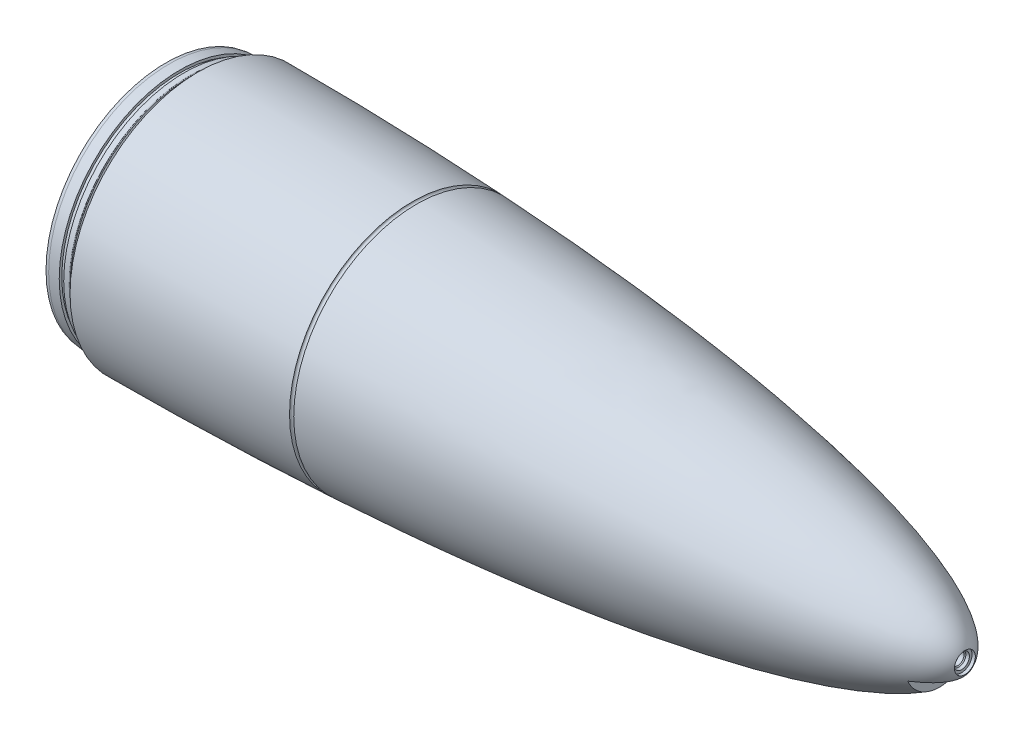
ISO-10303-21;
HEADER;
FILE_DESCRIPTION(('STEP AP214'),'2;1');
FILE_NAME('part.step','',(''),(''),'','','');
FILE_SCHEMA(('AUTOMOTIVE_DESIGN { 1 0 10303 214 1 1 1 1 }'));
ENDSEC;
DATA;
#1=APPLICATION_CONTEXT('core data for automotive mechanical design processes');
#2=APPLICATION_PROTOCOL_DEFINITION('international standard','automotive_design',2000,#1);
#3=PRODUCT_CONTEXT('',#1,'mechanical');
#4=PRODUCT('Part','Part','',(#3));
#5=PRODUCT_RELATED_PRODUCT_CATEGORY('part','',(#4));
#6=PRODUCT_DEFINITION_FORMATION('','',#4);
#7=PRODUCT_DEFINITION_CONTEXT('part definition',#1,'design');
#8=PRODUCT_DEFINITION('design','',#6,#7);
#9=PRODUCT_DEFINITION_SHAPE('','',#8);
#10=(LENGTH_UNIT() NAMED_UNIT(*) SI_UNIT(.MILLI.,.METRE.));
#11=(NAMED_UNIT(*) PLANE_ANGLE_UNIT() SI_UNIT($,.RADIAN.));
#12=(NAMED_UNIT(*) SI_UNIT($,.STERADIAN.) SOLID_ANGLE_UNIT());
#13=UNCERTAINTY_MEASURE_WITH_UNIT(LENGTH_MEASURE(1.E-05),#10,'distance_accuracy_value','');
#14=(GEOMETRIC_REPRESENTATION_CONTEXT(3) GLOBAL_UNCERTAINTY_ASSIGNED_CONTEXT((#13)) GLOBAL_UNIT_ASSIGNED_CONTEXT((#10,
#11,#12)) REPRESENTATION_CONTEXT('',''));
#15=CARTESIAN_POINT('',(0.,0.,0.));
#16=DIRECTION('',(0.,0.,1.));
#17=DIRECTION('',(1.,0.,0.));
#18=AXIS2_PLACEMENT_3D('',#15,#16,#17);
#19=CARTESIAN_POINT('',(0.,0.,0.));
#20=DIRECTION('',(0.,0.,1.));
#21=DIRECTION('',(1.,0.,0.));
#22=AXIS2_PLACEMENT_3D('',#19,#20,#21);
#23=ELLIPSE('',#22,609.6,101.346);
#24=TRIMMED_CURVE('',#23,(PARAMETER_VALUE(3.14159265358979)),
(PARAMETER_VALUE(6.28318530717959)),.T.,.PARAMETER.);
#25=CARTESIAN_POINT('',(0.,0.,0.));
#26=DIRECTION('',(-1.,0.,0.));
#27=AXIS1_PLACEMENT('',#25,#26);
#28=SURFACE_OF_REVOLUTION('',#24,#27);
#29=CARTESIAN_POINT('',(607.568,0.,0.));
#30=DIRECTION('',(-1.,0.,0.));
#31=DIRECTION('',(0.,0.,1.));
#32=AXIS2_PLACEMENT_3D('',#29,#30,#31);
#33=CIRCLE('',#32,8.26796765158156);
#34=CARTESIAN_POINT('',(607.568,0.,8.26796765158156));
#35=VERTEX_POINT('',#34);
#36=EDGE_CURVE('E222',#35,#35,#33,.T.);
#37=ORIENTED_EDGE('',*,*,#36,.T.);
#38=EDGE_LOOP('',(#37));
#39=FACE_BOUND('',#38,.T.);
#40=CARTESIAN_POINT('',(173.035599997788,0.,0.));
#41=DIRECTION('',(-1.,0.,0.));
#42=DIRECTION('',(0.,0.,1.));
#43=AXIS2_PLACEMENT_3D('',#40,#41,#42);
#44=CIRCLE('',#43,97.1774754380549);
#45=CARTESIAN_POINT('',(173.035599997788,0.,97.1774754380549));
#46=VERTEX_POINT('',#45);
#47=EDGE_CURVE('E64',#46,#46,#44,.T.);
#48=ORIENTED_EDGE('',*,*,#47,.F.);
#49=EDGE_LOOP('',(#48));
#50=FACE_BOUND('',#49,.T.);
#51=CARTESIAN_POINT('',(587.375,0.,0.));
#52=DIRECTION('',(-1.,0.,0.));
#53=DIRECTION('',(0.,0.,1.));
#54=AXIS2_PLACEMENT_3D('',#51,#52,#53);
#55=CIRCLE('',#54,27.1159658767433);
#56=CARTESIAN_POINT('',(587.375,-10.3301058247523,-25.0711890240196));
#57=VERTEX_POINT('',#56);
#58=CARTESIAN_POINT('',(587.375,-10.3301058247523,25.0711890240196));
#59=VERTEX_POINT('',#58);
#60=EDGE_CURVE('E50',#57,#59,#55,.T.);
#61=ORIENTED_EDGE('',*,*,#60,.T.);
#62=CARTESIAN_POINT('',(587.375,-10.3301058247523,25.0711890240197));
#63=CARTESIAN_POINT('',(587.928647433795,-10.3301058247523,24.7126424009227));
#64=CARTESIAN_POINT('',(588.478619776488,-10.3301058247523,24.3483554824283));
#65=CARTESIAN_POINT('',(589.571868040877,-10.3301058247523,23.6061020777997));
#66=CARTESIAN_POINT('',(590.115116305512,-10.3301058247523,23.2280948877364));
#67=CARTESIAN_POINT('',(591.192946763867,-10.3301058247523,22.4578112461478));
#68=CARTESIAN_POINT('',(591.7275110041,-10.3301058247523,22.0655096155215));
#69=CARTESIAN_POINT('',(592.785858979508,-10.3301058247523,21.2658869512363));
#70=CARTESIAN_POINT('',(593.309635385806,-10.3301058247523,20.8585561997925));
#71=CARTESIAN_POINT('',(594.354960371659,-10.3301058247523,20.0193179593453));
#72=CARTESIAN_POINT('',(594.876242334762,-10.3301058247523,19.5870775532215));
#73=CARTESIAN_POINT('',(595.902807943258,-10.3301058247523,18.7047316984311));
#74=CARTESIAN_POINT('',(596.408103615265,-10.3301058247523,18.2546402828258));
#75=CARTESIAN_POINT('',(597.39994124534,-10.3301058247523,17.3350834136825));
#76=CARTESIAN_POINT('',(597.886499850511,-10.3301058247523,16.8656359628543));
#77=CARTESIAN_POINT('',(598.837812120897,-10.3301058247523,15.9054582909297));
#78=CARTESIAN_POINT('',(599.302575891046,-10.3301058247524,15.4147381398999));
#79=CARTESIAN_POINT('',(600.041045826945,-10.3301058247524,14.5938481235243));
#80=CARTESIAN_POINT('',(600.322460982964,-10.3301058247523,14.2705987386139));
#81=CARTESIAN_POINT('',(600.873698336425,-10.3301058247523,13.6142939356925));
#82=CARTESIAN_POINT('',(601.143519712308,-10.3301058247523,13.2812378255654));
#83=CARTESIAN_POINT('',(601.670147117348,-10.3301058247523,12.604909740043));
#84=CARTESIAN_POINT('',(601.926951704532,-10.3301058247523,12.2616366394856));
#85=CARTESIAN_POINT('',(602.424974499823,-10.3301058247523,11.5658573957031));
#86=CARTESIAN_POINT('',(602.666246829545,-10.3301058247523,11.2133900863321));
#87=CARTESIAN_POINT('',(603.132429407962,-10.3301058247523,10.4977873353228));
#88=CARTESIAN_POINT('',(603.357340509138,-10.3301058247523,10.1346524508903));
#89=CARTESIAN_POINT('',(603.788790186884,-10.3301058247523,9.39766493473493));
#90=CARTESIAN_POINT('',(603.995330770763,-10.3301058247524,9.02381347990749));
#91=CARTESIAN_POINT('',(604.440281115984,-10.3301058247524,8.1642708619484));
#92=CARTESIAN_POINT('',(604.672499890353,-10.3301058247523,7.67534312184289));
#93=CARTESIAN_POINT('',(605.099308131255,-10.3301058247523,6.68128054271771));
#94=CARTESIAN_POINT('',(605.293900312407,-10.3301058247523,6.17614687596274));
#95=CARTESIAN_POINT('',(605.640570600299,-10.3301058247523,5.15184761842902));
#96=CARTESIAN_POINT('',(605.792682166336,-10.3301058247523,4.63269342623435));
#97=CARTESIAN_POINT('',(606.050188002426,-10.3301058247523,3.58278296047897));
#98=CARTESIAN_POINT('',(606.155583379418,-10.3301058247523,3.05202696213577));
#99=CARTESIAN_POINT('',(606.289893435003,-10.3301058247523,2.15823428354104));
#100=CARTESIAN_POINT('',(606.332552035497,-10.3301058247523,1.7972159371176));
#101=CARTESIAN_POINT('',(606.394554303,-10.3301058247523,1.07312799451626));
#102=CARTESIAN_POINT('',(606.413896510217,-10.3301058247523,0.710058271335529));
#103=CARTESIAN_POINT('',(606.428929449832,-10.3301058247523,-0.0165343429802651));
#104=CARTESIAN_POINT('',(606.424622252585,-10.3301058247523,-0.380057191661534));
#105=CARTESIAN_POINT('',(606.392431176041,-10.3301058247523,-1.10616027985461));
#106=CARTESIAN_POINT('',(606.364540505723,-10.3301058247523,-1.46874021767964));
#107=CARTESIAN_POINT('',(606.285625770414,-10.3301058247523,-2.19139136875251));
#108=CARTESIAN_POINT('',(606.234599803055,-10.3301058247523,-2.55146237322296));
#109=CARTESIAN_POINT('',(606.110211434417,-10.3301058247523,-3.26771787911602));
#110=CARTESIAN_POINT('',(606.036849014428,-10.3301058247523,-3.62390237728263));
#111=CARTESIAN_POINT('',(605.885153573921,-10.3301058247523,-4.26264414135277));
#112=CARTESIAN_POINT('',(605.810539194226,-10.3301058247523,-4.54609270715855));
#113=CARTESIAN_POINT('',(605.648164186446,-10.3301058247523,-5.10920077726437));
#114=CARTESIAN_POINT('',(605.560402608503,-10.3301058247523,-5.38886000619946));
#115=CARTESIAN_POINT('',(605.278457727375,-10.3301058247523,-6.2214893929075));
#116=CARTESIAN_POINT('',(605.065587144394,-10.3301058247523,-6.76822356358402));
#117=CARTESIAN_POINT('',(604.595915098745,-10.3301058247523,-7.84303536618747));
#118=CARTESIAN_POINT('',(604.33905871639,-10.3301058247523,-8.37108866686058));
#119=CARTESIAN_POINT('',(603.787448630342,-10.3301058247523,-9.40714310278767));
#120=CARTESIAN_POINT('',(603.492684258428,-10.3301058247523,-9.91513854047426));
#121=CARTESIAN_POINT('',(603.013396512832,-10.3301058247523,-10.682493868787));
#122=CARTESIAN_POINT('',(602.840280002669,-10.3301058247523,-10.9490797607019));
#123=CARTESIAN_POINT('',(602.485371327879,-10.3301058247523,-11.476311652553));
#124=CARTESIAN_POINT('',(602.303581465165,-10.3301058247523,-11.7369592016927));
#125=CARTESIAN_POINT('',(601.745995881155,-10.3301058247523,-12.5105825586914));
#126=CARTESIAN_POINT('',(601.358176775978,-10.3301058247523,-13.0149336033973));
#127=CARTESIAN_POINT('',(600.55561086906,-10.3301058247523,-14.0017756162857));
#128=CARTESIAN_POINT('',(600.140857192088,-10.3301058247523,-14.4842609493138));
#129=CARTESIAN_POINT('',(599.286827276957,-10.3301058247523,-15.4307403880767));
#130=CARTESIAN_POINT('',(598.847452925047,-10.3301058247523,-15.8946456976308));
#131=CARTESIAN_POINT('',(597.949479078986,-10.3301058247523,-16.8030677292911));
#132=CARTESIAN_POINT('',(597.490886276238,-10.3301058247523,-17.2475910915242));
#133=CARTESIAN_POINT('',(596.557215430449,-10.3301058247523,-18.1188497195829));
#134=CARTESIAN_POINT('',(596.082138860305,-10.3301058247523,-18.545586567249));
#135=CARTESIAN_POINT('',(595.275198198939,-10.3301058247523,-19.2460481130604));
#136=CARTESIAN_POINT('',(594.947202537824,-10.3301058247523,-19.524252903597));
#137=CARTESIAN_POINT('',(594.285383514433,-10.3301058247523,-20.0736140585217));
#138=CARTESIAN_POINT('',(593.951560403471,-10.3301058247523,-20.344770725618));
#139=CARTESIAN_POINT('',(593.278591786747,-10.3301058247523,-20.8804319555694));
#140=CARTESIAN_POINT('',(592.93944594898,-10.3301058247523,-21.1449361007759));
#141=CARTESIAN_POINT('',(592.256292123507,-10.3301058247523,-21.6676459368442));
#142=CARTESIAN_POINT('',(591.912283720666,-10.3301058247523,-21.9258510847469));
#143=CARTESIAN_POINT('',(591.224431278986,-10.3301058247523,-22.4328879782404));
#144=CARTESIAN_POINT('',(590.880645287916,-10.3301058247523,-22.6817985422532));
#145=CARTESIAN_POINT('',(590.189147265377,-10.3301058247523,-23.1740585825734));
#146=CARTESIAN_POINT('',(589.841435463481,-10.3301058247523,-23.4174083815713));
#147=CARTESIAN_POINT('',(589.142459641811,-10.3301058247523,-23.8987837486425));
#148=CARTESIAN_POINT('',(588.791196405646,-10.3301058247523,-24.1368104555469));
#149=CARTESIAN_POINT('',(588.085466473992,-10.3301058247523,-24.6077470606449));
#150=CARTESIAN_POINT('',(587.731001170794,-10.3301058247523,-24.8406590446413));
#151=CARTESIAN_POINT('',(587.375,-10.3301058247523,-25.0711890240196));
#152=B_SPLINE_CURVE_WITH_KNOTS('',3,(#62,#63,#64,#65,#66,#67,#68,#69,#70,#71,#72,#73,#74,#75,
#76,#77,#78,#79,#80,#81,#82,#83,#84,#85,#86,#87,#88,#89,#90,#91,#92,#93,#94,#95,#96,#97,#98,#99,
#100,#101,#102,#103,#104,#105,#106,#107,#108,#109,#110,#111,#112,#113,#114,#115,#116,#117,#118,
#119,#120,#121,#122,#123,#124,#125,#126,#127,#128,#129,#130,#131,#132,#133,#134,#135,#136,#137,
#138,#139,#140,#141,#142,#143,#144,#145,#146,#147,#148,#149,#150,#151),.UNSPECIFIED.,.F.,.F.,(4,
2,2,2,2,2,2,2,2,2,2,2,2,2,2,2,2,2,2,2,2,2,2,2,2,2,2,2,2,2,2,2,2,2,2,2,2,2,2,2,2,2,2,2,4),(0.,
1.97883806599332,3.96412364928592,5.95309353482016,7.94337283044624,9.97452240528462,
12.0041057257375,14.0318421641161,16.0586289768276,17.3441531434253,18.6297682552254,
19.9155254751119,21.1965284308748,22.4774645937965,23.7582606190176,25.3806366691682,
27.002895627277,28.6238732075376,30.2448123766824,31.3347182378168,32.4246923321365,
33.5145710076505,34.6047636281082,35.695045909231,36.7853291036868,37.6643167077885,
38.5433678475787,40.3011247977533,42.0610926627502,43.8215569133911,44.7749986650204,
45.7281887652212,47.6356503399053,49.5436007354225,51.4597858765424,53.3753093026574,
55.2906620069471,56.5808462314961,57.8709749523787,59.1611844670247,60.4515048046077,
61.7247528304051,62.9979267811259,64.2708256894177,65.5431954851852),.UNSPECIFIED.);
#153=EDGE_CURVE('E11',#59,#57,#152,.T.);
#154=ORIENTED_EDGE('',*,*,#153,.T.);
#155=EDGE_LOOP('',(#61,#154));
#156=FACE_BOUND('',#155,.T.);
#157=ADVANCED_FACE('F36',(#39,#50,#156),#28,.F.);
#158=CARTESIAN_POINT('',(169.864362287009,0.,0.));
#159=DIRECTION('',(-1.,0.,0.));
#160=DIRECTION('',(0.,0.,1.));
#161=AXIS2_PLACEMENT_3D('',#158,#159,#160);
#162=CIRCLE('',#161,97.3319933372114);
#163=CARTESIAN_POINT('',(169.864362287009,0.,97.3319933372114));
#164=VERTEX_POINT('',#163);
#165=EDGE_CURVE('E68',#164,#164,#162,.F.);
#166=ORIENTED_EDGE('',*,*,#165,.F.);
#167=EDGE_LOOP('',(#166));
#168=FACE_BOUND('',#167,.T.);
#169=CARTESIAN_POINT('',(6.63011312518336E-11,0.,0.));
#170=DIRECTION('',(-1.,0.,0.));
#171=DIRECTION('',(0.,0.,1.));
#172=AXIS2_PLACEMENT_3D('',#169,#170,#171);
#173=CIRCLE('',#172,101.346);
#174=CARTESIAN_POINT('',(6.63011312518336E-11,0.,101.346));
#175=VERTEX_POINT('',#174);
#176=EDGE_CURVE('E170',#175,#175,#173,.F.);
#177=ORIENTED_EDGE('',*,*,#176,.T.);
#178=EDGE_LOOP('',(#177));
#179=FACE_BOUND('',#178,.T.);
#180=ADVANCED_FACE('F212',(#168,#179),#28,.F.);
#181=CARTESIAN_POINT('',(594.868000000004,0.,0.));
#182=DIRECTION('',(1.,0.,0.));
#183=DIRECTION('',(0.,0.,-1.));
#184=AXIS2_PLACEMENT_3D('',#181,#182,#183);
#185=CYLINDRICAL_SURFACE('',#184,4.96062);
#186=CARTESIAN_POINT('',(601.892821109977,0.,0.));
#187=DIRECTION('',(1.,0.,0.));
#188=DIRECTION('',(0.,0.,-1.));
#189=AXIS2_PLACEMENT_3D('',#186,#187,#188);
#190=CIRCLE('',#189,4.96062);
#191=CARTESIAN_POINT('',(601.892821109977,0.,-4.96062));
#192=VERTEX_POINT('',#191);
#193=EDGE_CURVE('E78',#192,#192,#190,.T.);
#194=ORIENTED_EDGE('',*,*,#193,.T.);
#195=EDGE_LOOP('',(#194));
#196=FACE_BOUND('',#195,.T.);
#197=CARTESIAN_POINT('',(594.868000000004,0.,0.));
#198=DIRECTION('',(1.,0.,0.));
#199=DIRECTION('',(0.,0.,-1.));
#200=AXIS2_PLACEMENT_3D('',#197,#198,#199);
#201=CIRCLE('',#200,4.96062);
#202=CARTESIAN_POINT('',(594.868000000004,0.,-4.96062));
#203=VERTEX_POINT('',#202);
#204=EDGE_CURVE('E87',#203,#203,#201,.T.);
#205=ORIENTED_EDGE('',*,*,#204,.F.);
#206=EDGE_LOOP('',(#205));
#207=FACE_BOUND('',#206,.T.);
#208=ADVANCED_FACE('F217',(#196,#207),#185,.F.);
#209=CARTESIAN_POINT('',(584.708,0.,0.));
#210=DIRECTION('',(1.,0.,0.));
#211=DIRECTION('',(0.,0.,-1.));
#212=AXIS2_PLACEMENT_3D('',#209,#210,#211);
#213=CYLINDRICAL_SURFACE('',#212,4.953);
#214=CARTESIAN_POINT('',(584.708,0.,0.));
#215=DIRECTION('',(1.,0.,0.));
#216=DIRECTION('',(0.,0.,-1.));
#217=AXIS2_PLACEMENT_3D('',#214,#215,#216);
#218=CIRCLE('',#217,4.953);
#219=CARTESIAN_POINT('',(584.708,0.,-4.953));
#220=VERTEX_POINT('',#219);
#221=EDGE_CURVE('E94',#220,#220,#218,.T.);
#222=ORIENTED_EDGE('',*,*,#221,.F.);
#223=EDGE_LOOP('',(#222));
#224=FACE_BOUND('',#223,.T.);
#225=CARTESIAN_POINT('',(594.868000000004,0.,0.));
#226=DIRECTION('',(1.,0.,0.));
#227=DIRECTION('',(0.,0.,-1.));
#228=AXIS2_PLACEMENT_3D('',#225,#226,#227);
#229=CIRCLE('',#228,4.953);
#230=CARTESIAN_POINT('',(594.868000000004,0.,-4.953));
#231=VERTEX_POINT('',#230);
#232=EDGE_CURVE('E90',#231,#231,#229,.F.);
#233=ORIENTED_EDGE('',*,*,#232,.F.);
#234=EDGE_LOOP('',(#233));
#235=FACE_BOUND('',#234,.T.);
#236=ADVANCED_FACE('F256',(#224,#235),#213,.F.);
#237=CARTESIAN_POINT('',(-25.4,0.,0.));
#238=DIRECTION('',(-1.,0.,0.));
#239=DIRECTION('',(0.,0.,1.));
#240=AXIS2_PLACEMENT_3D('',#237,#238,#239);
#241=PLANE('',#240);
#242=CARTESIAN_POINT('',(-25.4,64.6578440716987,-64.6578440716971));
#243=DIRECTION('',(-1.,0.,0.));
#244=DIRECTION('',(0.,0.,1.));
#245=AXIS2_PLACEMENT_3D('',#242,#243,#244);
#246=CIRCLE('',#245,1.7272);
#247=CARTESIAN_POINT('',(-25.4,64.6578440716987,-62.9306440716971));
#248=VERTEX_POINT('',#247);
#249=EDGE_CURVE('E103',#248,#248,#246,.T.);
#250=ORIENTED_EDGE('',*,*,#249,.F.);
#251=EDGE_LOOP('',(#250));
#252=FACE_BOUND('',#251,.T.);
#253=CARTESIAN_POINT('',(-25.4,9.57783715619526E-13,-91.44));
#254=DIRECTION('',(-1.,0.,0.));
#255=DIRECTION('',(0.,0.,1.));
#256=AXIS2_PLACEMENT_3D('',#253,#254,#255);
#257=CIRCLE('',#256,1.7272);
#258=CARTESIAN_POINT('',(-25.4,9.57783715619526E-13,-89.7128));
#259=VERTEX_POINT('',#258);
#260=EDGE_CURVE('E107',#259,#259,#257,.T.);
#261=ORIENTED_EDGE('',*,*,#260,.F.);
#262=EDGE_LOOP('',(#261));
#263=FACE_BOUND('',#262,.T.);
#264=CARTESIAN_POINT('',(-25.4,-64.6578440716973,-64.6578440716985));
#265=DIRECTION('',(-1.,0.,0.));
#266=DIRECTION('',(0.,0.,1.));
#267=AXIS2_PLACEMENT_3D('',#264,#265,#266);
#268=CIRCLE('',#267,1.7272);
#269=CARTESIAN_POINT('',(-25.4,-64.6578440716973,-62.9306440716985));
#270=VERTEX_POINT('',#269);
#271=EDGE_CURVE('E113',#270,#270,#268,.T.);
#272=ORIENTED_EDGE('',*,*,#271,.F.);
#273=EDGE_LOOP('',(#272));
#274=FACE_BOUND('',#273,.T.);
#275=CARTESIAN_POINT('',(-25.4,-91.44,-6.38522477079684E-13));
#276=DIRECTION('',(-1.,0.,0.));
#277=DIRECTION('',(0.,0.,1.));
#278=AXIS2_PLACEMENT_3D('',#275,#276,#277);
#279=CIRCLE('',#278,1.7272);
#280=CARTESIAN_POINT('',(-25.4,-91.44,1.72719999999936));
#281=VERTEX_POINT('',#280);
#282=EDGE_CURVE('E119',#281,#281,#279,.T.);
#283=ORIENTED_EDGE('',*,*,#282,.F.);
#284=EDGE_LOOP('',(#283));
#285=FACE_BOUND('',#284,.T.);
#286=CARTESIAN_POINT('',(-25.4,-64.6578440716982,64.6578440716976));
#287=DIRECTION('',(-1.,0.,0.));
#288=DIRECTION('',(0.,0.,1.));
#289=AXIS2_PLACEMENT_3D('',#286,#287,#288);
#290=CIRCLE('',#289,1.72720000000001);
#291=CARTESIAN_POINT('',(-25.4,-64.6578440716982,66.3850440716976));
#292=VERTEX_POINT('',#291);
#293=EDGE_CURVE('E125',#292,#292,#290,.T.);
#294=ORIENTED_EDGE('',*,*,#293,.F.);
#295=EDGE_LOOP('',(#294));
#296=FACE_BOUND('',#295,.T.);
#297=CARTESIAN_POINT('',(-25.4,-3.19261238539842E-13,91.44));
#298=DIRECTION('',(-1.,0.,0.));
#299=DIRECTION('',(0.,0.,1.));
#300=AXIS2_PLACEMENT_3D('',#297,#298,#299);
#301=CIRCLE('',#300,1.7272);
#302=CARTESIAN_POINT('',(-25.4,-3.19261238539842E-13,93.1672));
#303=VERTEX_POINT('',#302);
#304=EDGE_CURVE('E131',#303,#303,#301,.T.);
#305=ORIENTED_EDGE('',*,*,#304,.F.);
#306=EDGE_LOOP('',(#305));
#307=FACE_BOUND('',#306,.T.);
#308=CARTESIAN_POINT('',(-25.4,64.6578440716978,64.657844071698));
#309=DIRECTION('',(-1.,0.,0.));
#310=DIRECTION('',(0.,0.,1.));
#311=AXIS2_PLACEMENT_3D('',#308,#309,#310);
#312=CIRCLE('',#311,1.7272);
#313=CARTESIAN_POINT('',(-25.4,64.6578440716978,66.385044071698));
#314=VERTEX_POINT('',#313);
#315=EDGE_CURVE('E137',#314,#314,#312,.T.);
#316=ORIENTED_EDGE('',*,*,#315,.F.);
#317=EDGE_LOOP('',(#316));
#318=FACE_BOUND('',#317,.T.);
#319=CARTESIAN_POINT('',(-25.4,91.44,0.));
#320=DIRECTION('',(-1.,0.,0.));
#321=DIRECTION('',(0.,0.,1.));
#322=AXIS2_PLACEMENT_3D('',#319,#320,#321);
#323=CIRCLE('',#322,1.7272);
#324=CARTESIAN_POINT('',(-25.4,91.44,1.7272));
#325=VERTEX_POINT('',#324);
#326=EDGE_CURVE('E143',#325,#325,#323,.T.);
#327=ORIENTED_EDGE('',*,*,#326,.F.);
#328=EDGE_LOOP('',(#327));
#329=FACE_BOUND('',#328,.T.);
#330=CARTESIAN_POINT('',(-25.4,0.,0.));
#331=DIRECTION('',(-1.,0.,0.));
#332=DIRECTION('',(0.,0.,1.));
#333=AXIS2_PLACEMENT_3D('',#330,#331,#332);
#334=CIRCLE('',#333,94.996);
#335=CARTESIAN_POINT('',(-25.4,0.,94.996));
#336=VERTEX_POINT('',#335);
#337=EDGE_CURVE('E408',#336,#336,#334,.T.);
#338=ORIENTED_EDGE('',*,*,#337,.T.);
#339=EDGE_LOOP('',(#338));
#340=FACE_BOUND('',#339,.T.);
#341=CARTESIAN_POINT('',(-25.4,0.,0.));
#342=DIRECTION('',(-1.,0.,0.));
#343=DIRECTION('',(0.,0.,1.));
#344=AXIS2_PLACEMENT_3D('',#341,#342,#343);
#345=CIRCLE('',#344,87.63);
#346=CARTESIAN_POINT('',(-25.4,0.,87.63));
#347=VERTEX_POINT('',#346);
#348=EDGE_CURVE('E173',#347,#347,#345,.T.);
#349=ORIENTED_EDGE('',*,*,#348,.F.);
#350=EDGE_LOOP('',(#349));
#351=FACE_BOUND('',#350,.T.);
#352=ADVANCED_FACE('F191',(#252,#263,#274,#285,#296,#307,#318,#329,#340,#351),#241,.T.);
#353=CARTESIAN_POINT('',(577.85,0.,0.));
#354=DIRECTION('',(-1.,0.,0.));
#355=DIRECTION('',(0.,0.,1.));
#356=AXIS2_PLACEMENT_3D('',#353,#354,#355);
#357=PLANE('',#356);
#358=CARTESIAN_POINT('',(577.85,0.,0.));
#359=DIRECTION('',(-1.,0.,0.));
#360=DIRECTION('',(0.,0.,1.));
#361=AXIS2_PLACEMENT_3D('',#358,#359,#360);
#362=CIRCLE('',#361,2.54);
#363=CARTESIAN_POINT('',(577.85,0.,2.54));
#364=VERTEX_POINT('',#363);
#365=EDGE_CURVE('E95',#364,#364,#362,.F.);
#366=ORIENTED_EDGE('',*,*,#365,.T.);
#367=EDGE_LOOP('',(#366));
#368=FACE_BOUND('',#367,.T.);
#369=CARTESIAN_POINT('',(577.85,0.,0.));
#370=DIRECTION('',(-1.,0.,0.));
#371=DIRECTION('',(0.,0.,1.));
#372=AXIS2_PLACEMENT_3D('',#369,#370,#371);
#373=CIRCLE('',#372,26.341576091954);
#374=CARTESIAN_POINT('',(577.85,0.,26.341576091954));
#375=VERTEX_POINT('',#374);
#376=EDGE_CURVE('E400',#375,#375,#373,.T.);
#377=ORIENTED_EDGE('',*,*,#376,.T.);
#378=EDGE_LOOP('',(#377));
#379=FACE_BOUND('',#378,.T.);
#380=ADVANCED_FACE('F187',(#368,#379),#357,.T.);
#381=CARTESIAN_POINT('',(0.,0.,0.));
#382=DIRECTION('',(0.,0.,-1.));
#383=DIRECTION('',(1.,0.,0.));
#384=AXIS2_PLACEMENT_3D('',#381,#382,#383);
#385=ELLIPSE('',#384,601.98,93.98);
#386=TRIMMED_CURVE('',#385,(PARAMETER_VALUE(0.)),(PARAMETER_VALUE(3.14159265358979)),.T.,.PARAMETER.);
#387=CARTESIAN_POINT('',(0.,0.,0.));
#388=DIRECTION('',(-1.,0.,0.));
#389=AXIS1_PLACEMENT('',#387,#388);
#390=SURFACE_OF_REVOLUTION('',#386,#389);
#391=CARTESIAN_POINT('',(217.522088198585,0.,0.));
#392=DIRECTION('',(-1.,0.,0.));
#393=DIRECTION('',(0.,0.,1.));
#394=AXIS2_PLACEMENT_3D('',#391,#392,#393);
#395=CIRCLE('',#394,87.63);
#396=CARTESIAN_POINT('',(217.522088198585,0.,87.63));
#397=VERTEX_POINT('',#396);
#398=EDGE_CURVE('E397',#397,#397,#395,.T.);
#399=ORIENTED_EDGE('',*,*,#398,.T.);
#400=EDGE_LOOP('',(#399));
#401=FACE_BOUND('',#400,.T.);
#402=ORIENTED_EDGE('',*,*,#376,.F.);
#403=EDGE_LOOP('',(#402));
#404=FACE_BOUND('',#403,.T.);
#405=ADVANCED_FACE('F182',(#401,#404),#390,.F.);
#406=CARTESIAN_POINT('',(0.,0.,0.));
#407=DIRECTION('',(-1.,0.,0.));
#408=DIRECTION('',(0.,0.,1.));
#409=AXIS2_PLACEMENT_3D('',#406,#407,#408);
#410=CYLINDRICAL_SURFACE('',#409,87.63);
#411=CARTESIAN_POINT('',(165.1,0.,0.));
#412=DIRECTION('',(-1.,0.,0.));
#413=DIRECTION('',(0.,0.,1.));
#414=AXIS2_PLACEMENT_3D('',#411,#412,#413);
#415=CIRCLE('',#414,87.63);
#416=CARTESIAN_POINT('',(165.1,0.,87.63));
#417=VERTEX_POINT('',#416);
#418=EDGE_CURVE('E396',#417,#417,#415,.T.);
#419=ORIENTED_EDGE('',*,*,#418,.T.);
#420=EDGE_LOOP('',(#419));
#421=FACE_BOUND('',#420,.T.);
#422=ORIENTED_EDGE('',*,*,#398,.F.);
#423=EDGE_LOOP('',(#422));
#424=FACE_BOUND('',#423,.T.);
#425=ADVANCED_FACE('F186',(#421,#424),#410,.F.);
#426=CARTESIAN_POINT('',(165.1,0.,0.));
#427=DIRECTION('',(-1.,0.,0.));
#428=DIRECTION('',(0.,0.,1.));
#429=AXIS2_PLACEMENT_3D('',#426,#427,#428);
#430=CONICAL_SURFACE('',#429,87.63,0.756834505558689);
#431=CARTESIAN_POINT('',(160.528,0.,0.));
#432=DIRECTION('',(-1.,0.,0.));
#433=DIRECTION('',(0.,0.,1.));
#434=AXIS2_PLACEMENT_3D('',#431,#432,#433);
#435=CIRCLE('',#434,91.948);
#436=CARTESIAN_POINT('',(160.528,0.,91.948));
#437=VERTEX_POINT('',#436);
#438=EDGE_CURVE('E393',#437,#437,#435,.T.);
#439=ORIENTED_EDGE('',*,*,#438,.T.);
#440=EDGE_LOOP('',(#439));
#441=FACE_BOUND('',#440,.T.);
#442=ORIENTED_EDGE('',*,*,#418,.F.);
#443=EDGE_LOOP('',(#442));
#444=FACE_BOUND('',#443,.T.);
#445=ADVANCED_FACE('F382',(#441,#444),#430,.F.);
#446=CARTESIAN_POINT('',(160.528,0.,0.));
#447=DIRECTION('',(-1.,0.,0.));
#448=DIRECTION('',(0.,0.,1.));
#449=AXIS2_PLACEMENT_3D('',#446,#447,#448);
#450=CONICAL_SURFACE('',#449,91.948,0.0218653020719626);
#451=CARTESIAN_POINT('',(32.766,0.,0.));
#452=DIRECTION('',(-1.,0.,0.));
#453=DIRECTION('',(0.,0.,1.));
#454=AXIS2_PLACEMENT_3D('',#451,#452,#453);
#455=CIRCLE('',#454,94.742);
#456=CARTESIAN_POINT('',(32.766,0.,94.742));
#457=VERTEX_POINT('',#456);
#458=EDGE_CURVE('E402',#457,#457,#455,.T.);
#459=ORIENTED_EDGE('',*,*,#458,.T.);
#460=EDGE_LOOP('',(#459));
#461=FACE_BOUND('',#460,.T.);
#462=ORIENTED_EDGE('',*,*,#438,.F.);
#463=EDGE_LOOP('',(#462));
#464=FACE_BOUND('',#463,.T.);
#465=ADVANCED_FACE('F379',(#461,#464),#450,.F.);
#466=CARTESIAN_POINT('',(32.766,0.,0.));
#467=DIRECTION('',(1.,0.,0.));
#468=DIRECTION('',(0.,0.,-1.));
#469=AXIS2_PLACEMENT_3D('',#466,#467,#468);
#470=CONICAL_SURFACE('',#469,94.742,0.767856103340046);
#471=CARTESIAN_POINT('',(25.4,0.,0.));
#472=DIRECTION('',(-1.,0.,0.));
#473=DIRECTION('',(0.,0.,1.));
#474=AXIS2_PLACEMENT_3D('',#471,#472,#473);
#475=CIRCLE('',#474,87.63);
#476=CARTESIAN_POINT('',(25.4,0.,87.63));
#477=VERTEX_POINT('',#476);
#478=EDGE_CURVE('E175',#477,#477,#475,.T.);
#479=ORIENTED_EDGE('',*,*,#478,.T.);
#480=EDGE_LOOP('',(#479));
#481=FACE_BOUND('',#480,.T.);
#482=ORIENTED_EDGE('',*,*,#458,.F.);
#483=EDGE_LOOP('',(#482));
#484=FACE_BOUND('',#483,.T.);
#485=ADVANCED_FACE('F375',(#481,#484),#470,.F.);
#486=CARTESIAN_POINT('',(0.,0.,0.));
#487=DIRECTION('',(-1.,0.,0.));
#488=DIRECTION('',(0.,0.,1.));
#489=AXIS2_PLACEMENT_3D('',#486,#487,#488);
#490=CYLINDRICAL_SURFACE('',#489,87.63);
#491=ORIENTED_EDGE('',*,*,#478,.F.);
#492=EDGE_LOOP('',(#491));
#493=FACE_BOUND('',#492,.T.);
#494=ORIENTED_EDGE('',*,*,#348,.T.);
#495=EDGE_LOOP('',(#494));
#496=FACE_BOUND('',#495,.T.);
#497=ADVANCED_FACE('F365',(#493,#496),#490,.F.);
#498=CARTESIAN_POINT('',(-6.604,0.,0.));
#499=DIRECTION('',(-1.,0.,0.));
#500=DIRECTION('',(0.,0.,1.));
#501=AXIS2_PLACEMENT_3D('',#498,#499,#500);
#502=CYLINDRICAL_SURFACE('',#501,95.4532);
#503=CARTESIAN_POINT('',(-22.86,0.,0.));
#504=DIRECTION('',(-1.,0.,0.));
#505=DIRECTION('',(0.,0.,1.));
#506=AXIS2_PLACEMENT_3D('',#503,#504,#505);
#507=CIRCLE('',#506,95.4532);
#508=CARTESIAN_POINT('',(-22.86,0.,95.4532));
#509=VERTEX_POINT('',#508);
#510=EDGE_CURVE('E419',#509,#509,#507,.F.);
#511=ORIENTED_EDGE('',*,*,#510,.T.);
#512=EDGE_LOOP('',(#511));
#513=FACE_BOUND('',#512,.T.);
#514=CARTESIAN_POINT('',(-14.478,0.,0.));
#515=DIRECTION('',(-1.,0.,0.));
#516=DIRECTION('',(0.,0.,1.));
#517=AXIS2_PLACEMENT_3D('',#514,#515,#516);
#518=CIRCLE('',#517,95.4532);
#519=CARTESIAN_POINT('',(-14.478,0.,95.4532));
#520=VERTEX_POINT('',#519);
#521=EDGE_CURVE('E162',#520,#520,#518,.F.);
#522=ORIENTED_EDGE('',*,*,#521,.F.);
#523=EDGE_LOOP('',(#522));
#524=FACE_BOUND('',#523,.T.);
#525=ADVANCED_FACE('F208',(#513,#524),#502,.T.);
#526=CARTESIAN_POINT('',(-10.922,0.,0.));
#527=DIRECTION('',(-1.,0.,0.));
#528=DIRECTION('',(0.,0.,1.));
#529=AXIS2_PLACEMENT_3D('',#526,#527,#528);
#530=PLANE('',#529);
#531=CARTESIAN_POINT('',(-10.922,0.,0.));
#532=DIRECTION('',(-1.,0.,0.));
#533=DIRECTION('',(0.,0.,1.));
#534=AXIS2_PLACEMENT_3D('',#531,#532,#533);
#535=CIRCLE('',#534,95.4532);
#536=CARTESIAN_POINT('',(-10.922,0.,95.4532));
#537=VERTEX_POINT('',#536);
#538=EDGE_CURVE('E167',#537,#537,#535,.F.);
#539=ORIENTED_EDGE('',*,*,#538,.F.);
#540=EDGE_LOOP('',(#539));
#541=FACE_BOUND('',#540,.T.);
#542=CARTESIAN_POINT('',(-10.922,0.,0.));
#543=DIRECTION('',(-1.,0.,0.));
#544=DIRECTION('',(0.,0.,1.));
#545=AXIS2_PLACEMENT_3D('',#542,#543,#544);
#546=CIRCLE('',#545,93.4212);
#547=CARTESIAN_POINT('',(-10.922,0.,93.4212));
#548=VERTEX_POINT('',#547);
#549=EDGE_CURVE('E158',#548,#548,#546,.T.);
#550=ORIENTED_EDGE('',*,*,#549,.F.);
#551=EDGE_LOOP('',(#550));
#552=FACE_BOUND('',#551,.T.);
#553=ADVANCED_FACE('F359',(#541,#552),#530,.T.);
#554=CARTESIAN_POINT('',(-14.478,0.,0.));
#555=DIRECTION('',(-1.,0.,0.));
#556=DIRECTION('',(0.,0.,1.));
#557=AXIS2_PLACEMENT_3D('',#554,#555,#556);
#558=PLANE('',#557);
#559=ORIENTED_EDGE('',*,*,#521,.T.);
#560=EDGE_LOOP('',(#559));
#561=FACE_BOUND('',#560,.T.);
#562=CARTESIAN_POINT('',(-14.478,0.,0.));
#563=DIRECTION('',(-1.,0.,0.));
#564=DIRECTION('',(0.,0.,1.));
#565=AXIS2_PLACEMENT_3D('',#562,#563,#564);
#566=CIRCLE('',#565,93.4212);
#567=CARTESIAN_POINT('',(-14.478,0.,93.4212));
#568=VERTEX_POINT('',#567);
#569=EDGE_CURVE('E155',#568,#568,#566,.T.);
#570=ORIENTED_EDGE('',*,*,#569,.T.);
#571=EDGE_LOOP('',(#570));
#572=FACE_BOUND('',#571,.T.);
#573=ADVANCED_FACE('F355',(#561,#572),#558,.F.);
#574=CARTESIAN_POINT('',(-10.922,0.,0.));
#575=DIRECTION('',(-1.,0.,0.));
#576=DIRECTION('',(0.,0.,1.));
#577=AXIS2_PLACEMENT_3D('',#574,#575,#576);
#578=CYLINDRICAL_SURFACE('',#577,93.4212);
#579=ORIENTED_EDGE('',*,*,#549,.T.);
#580=EDGE_LOOP('',(#579));
#581=FACE_BOUND('',#580,.T.);
#582=ORIENTED_EDGE('',*,*,#569,.F.);
#583=EDGE_LOOP('',(#582));
#584=FACE_BOUND('',#583,.T.);
#585=ADVANCED_FACE('F352',(#581,#584),#578,.T.);
#586=CARTESIAN_POINT('',(6.63011312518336E-11,0.,0.));
#587=DIRECTION('',(-1.,0.,0.));
#588=DIRECTION('',(0.,0.,1.));
#589=AXIS2_PLACEMENT_3D('',#586,#587,#588);
#590=CYLINDRICAL_SURFACE('',#589,95.9612);
#591=CARTESIAN_POINT('',(-6.096,0.,0.));
#592=DIRECTION('',(-1.,0.,0.));
#593=DIRECTION('',(0.,0.,1.));
#594=AXIS2_PLACEMENT_3D('',#591,#592,#593);
#595=CIRCLE('',#594,95.9612);
#596=CARTESIAN_POINT('',(-6.096,0.,95.9612));
#597=VERTEX_POINT('',#596);
#598=EDGE_CURVE('E62',#597,#597,#595,.F.);
#599=ORIENTED_EDGE('',*,*,#598,.T.);
#600=EDGE_LOOP('',(#599));
#601=FACE_BOUND('',#600,.T.);
#602=CARTESIAN_POINT('',(-5.334,0.,0.));
#603=DIRECTION('',(-1.,0.,0.));
#604=DIRECTION('',(0.,0.,1.));
#605=AXIS2_PLACEMENT_3D('',#602,#603,#604);
#606=CIRCLE('',#605,95.9612);
#607=CARTESIAN_POINT('',(-5.33399999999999,0.,95.9612));
#608=VERTEX_POINT('',#607);
#609=EDGE_CURVE('E154',#608,#608,#606,.F.);
#610=ORIENTED_EDGE('',*,*,#609,.F.);
#611=EDGE_LOOP('',(#610));
#612=FACE_BOUND('',#611,.T.);
#613=ADVANCED_FACE('F205',(#601,#612),#590,.T.);
#614=CARTESIAN_POINT('',(-6.604,0.,0.));
#615=DIRECTION('',(-1.,0.,0.));
#616=DIRECTION('',(0.,0.,1.));
#617=AXIS2_PLACEMENT_3D('',#614,#615,#616);
#618=CIRCLE('',#617,95.4532);
#619=CARTESIAN_POINT('',(-6.604,0.,95.4532));
#620=VERTEX_POINT('',#619);
#621=EDGE_CURVE('E163',#620,#620,#618,.T.);
#622=ORIENTED_EDGE('',*,*,#621,.T.);
#623=EDGE_LOOP('',(#622));
#624=FACE_BOUND('',#623,.T.);
#625=ORIENTED_EDGE('',*,*,#538,.T.);
#626=EDGE_LOOP('',(#625));
#627=FACE_BOUND('',#626,.T.);
#628=ADVANCED_FACE('F196',(#624,#627),#502,.T.);
#629=CARTESIAN_POINT('',(607.568,0.,0.));
#630=DIRECTION('',(1.,0.,0.));
#631=DIRECTION('',(0.,0.,-1.));
#632=AXIS2_PLACEMENT_3D('',#629,#630,#631);
#633=PLANE('',#632);
#634=CARTESIAN_POINT('',(607.568,0.,0.));
#635=DIRECTION('',(1.,0.,0.));
#636=DIRECTION('',(0.,0.,-1.));
#637=AXIS2_PLACEMENT_3D('',#634,#635,#636);
#638=CIRCLE('',#637,8.255);
#639=CARTESIAN_POINT('',(607.568,0.,-8.255));
#640=VERTEX_POINT('',#639);
#641=EDGE_CURVE('E100',#640,#640,#638,.T.);
#642=ORIENTED_EDGE('',*,*,#641,.F.);
#643=EDGE_LOOP('',(#642));
#644=FACE_BOUND('',#643,.T.);
#645=ORIENTED_EDGE('',*,*,#36,.F.);
#646=EDGE_LOOP('',(#645));
#647=FACE_BOUND('',#646,.T.);
#648=ADVANCED_FACE('F193',(#644,#647),#633,.T.);
#649=CARTESIAN_POINT('',(6.63011312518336E-11,0.,0.));
#650=DIRECTION('',(-1.,0.,0.));
#651=DIRECTION('',(0.,0.,1.));
#652=AXIS2_PLACEMENT_3D('',#649,#650,#651);
#653=PLANE('',#652);
#654=ORIENTED_EDGE('',*,*,#176,.F.);
#655=EDGE_LOOP('',(#654));
#656=FACE_BOUND('',#655,.T.);
#657=CARTESIAN_POINT('',(6.63011312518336E-11,0.,0.));
#658=DIRECTION('',(-1.,0.,0.));
#659=DIRECTION('',(0.,0.,1.));
#660=AXIS2_PLACEMENT_3D('',#657,#658,#659);
#661=CIRCLE('',#660,95.9612);
#662=CARTESIAN_POINT('',(6.63011312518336E-11,0.,95.9612));
#663=VERTEX_POINT('',#662);
#664=EDGE_CURVE('E166',#663,#663,#661,.T.);
#665=ORIENTED_EDGE('',*,*,#664,.F.);
#666=EDGE_LOOP('',(#665));
#667=FACE_BOUND('',#666,.T.);
#668=ADVANCED_FACE('F195',(#656,#667),#653,.T.);
#669=ORIENTED_EDGE('',*,*,#664,.T.);
#670=EDGE_LOOP('',(#669));
#671=FACE_BOUND('',#670,.T.);
#672=CARTESIAN_POINT('',(-2.032,0.,0.));
#673=DIRECTION('',(-1.,0.,0.));
#674=DIRECTION('',(0.,0.,1.));
#675=AXIS2_PLACEMENT_3D('',#672,#673,#674);
#676=CIRCLE('',#675,95.9612);
#677=CARTESIAN_POINT('',(-2.03199999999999,0.,95.9612));
#678=VERTEX_POINT('',#677);
#679=EDGE_CURVE('E159',#678,#678,#676,.F.);
#680=ORIENTED_EDGE('',*,*,#679,.T.);
#681=EDGE_LOOP('',(#680));
#682=FACE_BOUND('',#681,.T.);
#683=ADVANCED_FACE('F202',(#671,#682),#590,.T.);
#684=CARTESIAN_POINT('',(-3.683,0.,0.));
#685=DIRECTION('',(-1.,0.,0.));
#686=DIRECTION('',(0.,0.,1.));
#687=AXIS2_PLACEMENT_3D('',#684,#685,#686);
#688=TOROIDAL_SURFACE('',#687,95.9612,1.651);
#689=ORIENTED_EDGE('',*,*,#609,.T.);
#690=EDGE_LOOP('',(#689));
#691=FACE_BOUND('',#690,.T.);
#692=CARTESIAN_POINT('',(-3.683,0.,0.));
#693=DIRECTION('',(-1.,0.,0.));
#694=DIRECTION('',(0.,0.,1.));
#695=AXIS2_PLACEMENT_3D('',#692,#693,#694);
#696=CIRCLE('',#695,94.3102);
#697=CARTESIAN_POINT('',(-3.68299999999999,0.,94.3102));
#698=VERTEX_POINT('',#697);
#699=EDGE_CURVE('E149',#698,#698,#696,.F.);
#700=ORIENTED_EDGE('',*,*,#699,.F.);
#701=EDGE_LOOP('',(#700));
#702=FACE_BOUND('',#701,.T.);
#703=ADVANCED_FACE('F347',(#691,#702),#688,.F.);
#704=CARTESIAN_POINT('',(-3.683,0.,0.));
#705=DIRECTION('',(-1.,0.,0.));
#706=DIRECTION('',(0.,0.,1.));
#707=AXIS2_PLACEMENT_3D('',#704,#705,#706);
#708=TOROIDAL_SURFACE('',#707,95.9612,1.651);
#709=ORIENTED_EDGE('',*,*,#679,.F.);
#710=EDGE_LOOP('',(#709));
#711=FACE_BOUND('',#710,.T.);
#712=ORIENTED_EDGE('',*,*,#699,.T.);
#713=EDGE_LOOP('',(#712));
#714=FACE_BOUND('',#713,.T.);
#715=ADVANCED_FACE('F343',(#711,#714),#708,.F.);
#716=CARTESIAN_POINT('',(-25.4,0.,0.));
#717=DIRECTION('',(1.,0.,0.));
#718=DIRECTION('',(0.,0.,-1.));
#719=AXIS2_PLACEMENT_3D('',#716,#717,#718);
#720=CONICAL_SURFACE('',#719,94.996,0.178092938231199);
#721=ORIENTED_EDGE('',*,*,#510,.F.);
#722=EDGE_LOOP('',(#721));
#723=FACE_BOUND('',#722,.T.);
#724=ORIENTED_EDGE('',*,*,#337,.F.);
#725=EDGE_LOOP('',(#724));
#726=FACE_BOUND('',#725,.T.);
#727=ADVANCED_FACE('F339',(#723,#726),#720,.T.);
#728=CARTESIAN_POINT('',(-6.096,0.,0.));
#729=DIRECTION('',(1.,0.,0.));
#730=DIRECTION('',(0.,0.,-1.));
#731=AXIS2_PLACEMENT_3D('',#728,#729,#730);
#732=CONICAL_SURFACE('',#731,95.9612,0.785398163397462);
#733=ORIENTED_EDGE('',*,*,#621,.F.);
#734=EDGE_LOOP('',(#733));
#735=FACE_BOUND('',#734,.T.);
#736=ORIENTED_EDGE('',*,*,#598,.F.);
#737=EDGE_LOOP('',(#736));
#738=FACE_BOUND('',#737,.T.);
#739=ADVANCED_FACE('F335',(#735,#738),#732,.T.);
#740=CARTESIAN_POINT('',(-19.05,91.44,0.));
#741=DIRECTION('',(-1.,0.,0.));
#742=DIRECTION('',(0.,0.,1.));
#743=AXIS2_PLACEMENT_3D('',#740,#741,#742);
#744=CYLINDRICAL_SURFACE('',#743,1.7272);
#745=CARTESIAN_POINT('',(-19.05,91.44,0.));
#746=DIRECTION('',(-1.,0.,0.));
#747=DIRECTION('',(0.,0.,1.));
#748=AXIS2_PLACEMENT_3D('',#745,#746,#747);
#749=CIRCLE('',#748,1.7272);
#750=CARTESIAN_POINT('',(-19.05,91.44,1.7272));
#751=VERTEX_POINT('',#750);
#752=EDGE_CURVE('E146',#751,#751,#749,.T.);
#753=ORIENTED_EDGE('',*,*,#752,.F.);
#754=EDGE_LOOP('',(#753));
#755=FACE_BOUND('',#754,.T.);
#756=ORIENTED_EDGE('',*,*,#326,.T.);
#757=EDGE_LOOP('',(#756));
#758=FACE_BOUND('',#757,.T.);
#759=ADVANCED_FACE('F331',(#755,#758),#744,.F.);
#760=CARTESIAN_POINT('',(-19.05,91.44,0.));
#761=DIRECTION('',(-1.,0.,0.));
#762=DIRECTION('',(0.,0.,1.));
#763=AXIS2_PLACEMENT_3D('',#760,#761,#762);
#764=PLANE('',#763);
#765=ORIENTED_EDGE('',*,*,#752,.T.);
#766=EDGE_LOOP('',(#765));
#767=FACE_BOUND('',#766,.T.);
#768=ADVANCED_FACE('F327',(#767),#764,.T.);
#769=CARTESIAN_POINT('',(-19.05,64.6578440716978,64.657844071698));
#770=DIRECTION('',(-1.,0.,0.));
#771=DIRECTION('',(0.,0.,1.));
#772=AXIS2_PLACEMENT_3D('',#769,#770,#771);
#773=CYLINDRICAL_SURFACE('',#772,1.7272);
#774=CARTESIAN_POINT('',(-19.05,64.6578440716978,64.657844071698));
#775=DIRECTION('',(-1.,0.,0.));
#776=DIRECTION('',(0.,0.,1.));
#777=AXIS2_PLACEMENT_3D('',#774,#775,#776);
#778=CIRCLE('',#777,1.7272);
#779=CARTESIAN_POINT('',(-19.05,64.6578440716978,66.385044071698));
#780=VERTEX_POINT('',#779);
#781=EDGE_CURVE('E140',#780,#780,#778,.T.);
#782=ORIENTED_EDGE('',*,*,#781,.F.);
#783=EDGE_LOOP('',(#782));
#784=FACE_BOUND('',#783,.T.);
#785=ORIENTED_EDGE('',*,*,#315,.T.);
#786=EDGE_LOOP('',(#785));
#787=FACE_BOUND('',#786,.T.);
#788=ADVANCED_FACE('F323',(#784,#787),#773,.F.);
#789=CARTESIAN_POINT('',(-19.05,64.6578440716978,64.657844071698));
#790=DIRECTION('',(-1.,0.,0.));
#791=DIRECTION('',(0.,0.,1.));
#792=AXIS2_PLACEMENT_3D('',#789,#790,#791);
#793=PLANE('',#792);
#794=ORIENTED_EDGE('',*,*,#781,.T.);
#795=EDGE_LOOP('',(#794));
#796=FACE_BOUND('',#795,.T.);
#797=ADVANCED_FACE('F319',(#796),#793,.T.);
#798=CARTESIAN_POINT('',(-19.05,-3.19261238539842E-13,91.44));
#799=DIRECTION('',(-1.,0.,0.));
#800=DIRECTION('',(0.,0.,1.));
#801=AXIS2_PLACEMENT_3D('',#798,#799,#800);
#802=CYLINDRICAL_SURFACE('',#801,1.7272);
#803=CARTESIAN_POINT('',(-19.05,-3.19261238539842E-13,91.44));
#804=DIRECTION('',(-1.,0.,0.));
#805=DIRECTION('',(0.,0.,1.));
#806=AXIS2_PLACEMENT_3D('',#803,#804,#805);
#807=CIRCLE('',#806,1.7272);
#808=CARTESIAN_POINT('',(-19.05,-3.19261238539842E-13,93.1672));
#809=VERTEX_POINT('',#808);
#810=EDGE_CURVE('E134',#809,#809,#807,.T.);
#811=ORIENTED_EDGE('',*,*,#810,.F.);
#812=EDGE_LOOP('',(#811));
#813=FACE_BOUND('',#812,.T.);
#814=ORIENTED_EDGE('',*,*,#304,.T.);
#815=EDGE_LOOP('',(#814));
#816=FACE_BOUND('',#815,.T.);
#817=ADVANCED_FACE('F315',(#813,#816),#802,.F.);
#818=CARTESIAN_POINT('',(-19.05,-3.19261238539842E-13,91.44));
#819=DIRECTION('',(-1.,0.,0.));
#820=DIRECTION('',(0.,0.,1.));
#821=AXIS2_PLACEMENT_3D('',#818,#819,#820);
#822=PLANE('',#821);
#823=ORIENTED_EDGE('',*,*,#810,.T.);
#824=EDGE_LOOP('',(#823));
#825=FACE_BOUND('',#824,.T.);
#826=ADVANCED_FACE('F311',(#825),#822,.T.);
#827=CARTESIAN_POINT('',(-19.05,-64.6578440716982,64.6578440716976));
#828=DIRECTION('',(-1.,0.,0.));
#829=DIRECTION('',(0.,0.,1.));
#830=AXIS2_PLACEMENT_3D('',#827,#828,#829);
#831=CYLINDRICAL_SURFACE('',#830,1.72720000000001);
#832=CARTESIAN_POINT('',(-19.05,-64.6578440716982,64.6578440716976));
#833=DIRECTION('',(-1.,0.,0.));
#834=DIRECTION('',(0.,0.,1.));
#835=AXIS2_PLACEMENT_3D('',#832,#833,#834);
#836=CIRCLE('',#835,1.72720000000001);
#837=CARTESIAN_POINT('',(-19.05,-64.6578440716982,66.3850440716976));
#838=VERTEX_POINT('',#837);
#839=EDGE_CURVE('E128',#838,#838,#836,.T.);
#840=ORIENTED_EDGE('',*,*,#839,.F.);
#841=EDGE_LOOP('',(#840));
#842=FACE_BOUND('',#841,.T.);
#843=ORIENTED_EDGE('',*,*,#293,.T.);
#844=EDGE_LOOP('',(#843));
#845=FACE_BOUND('',#844,.T.);
#846=ADVANCED_FACE('F307',(#842,#845),#831,.F.);
#847=CARTESIAN_POINT('',(-19.05,-64.6578440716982,64.6578440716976));
#848=DIRECTION('',(-1.,0.,0.));
#849=DIRECTION('',(0.,0.,1.));
#850=AXIS2_PLACEMENT_3D('',#847,#848,#849);
#851=PLANE('',#850);
#852=ORIENTED_EDGE('',*,*,#839,.T.);
#853=EDGE_LOOP('',(#852));
#854=FACE_BOUND('',#853,.T.);
#855=ADVANCED_FACE('F303',(#854),#851,.T.);
#856=CARTESIAN_POINT('',(-19.05,-91.44,-6.38522477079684E-13));
#857=DIRECTION('',(-1.,0.,0.));
#858=DIRECTION('',(0.,0.,1.));
#859=AXIS2_PLACEMENT_3D('',#856,#857,#858);
#860=CYLINDRICAL_SURFACE('',#859,1.7272);
#861=CARTESIAN_POINT('',(-19.05,-91.44,-6.38522477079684E-13));
#862=DIRECTION('',(-1.,0.,0.));
#863=DIRECTION('',(0.,0.,1.));
#864=AXIS2_PLACEMENT_3D('',#861,#862,#863);
#865=CIRCLE('',#864,1.7272);
#866=CARTESIAN_POINT('',(-19.05,-91.44,1.72719999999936));
#867=VERTEX_POINT('',#866);
#868=EDGE_CURVE('E122',#867,#867,#865,.T.);
#869=ORIENTED_EDGE('',*,*,#868,.F.);
#870=EDGE_LOOP('',(#869));
#871=FACE_BOUND('',#870,.T.);
#872=ORIENTED_EDGE('',*,*,#282,.T.);
#873=EDGE_LOOP('',(#872));
#874=FACE_BOUND('',#873,.T.);
#875=ADVANCED_FACE('F299',(#871,#874),#860,.F.);
#876=CARTESIAN_POINT('',(-19.05,-91.44,-6.38522477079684E-13));
#877=DIRECTION('',(-1.,0.,0.));
#878=DIRECTION('',(0.,0.,1.));
#879=AXIS2_PLACEMENT_3D('',#876,#877,#878);
#880=PLANE('',#879);
#881=ORIENTED_EDGE('',*,*,#868,.T.);
#882=EDGE_LOOP('',(#881));
#883=FACE_BOUND('',#882,.T.);
#884=ADVANCED_FACE('F295',(#883),#880,.T.);
#885=CARTESIAN_POINT('',(-19.05,-64.6578440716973,-64.6578440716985));
#886=DIRECTION('',(-1.,0.,0.));
#887=DIRECTION('',(0.,0.,1.));
#888=AXIS2_PLACEMENT_3D('',#885,#886,#887);
#889=CYLINDRICAL_SURFACE('',#888,1.7272);
#890=CARTESIAN_POINT('',(-19.05,-64.6578440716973,-64.6578440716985));
#891=DIRECTION('',(-1.,0.,0.));
#892=DIRECTION('',(0.,0.,1.));
#893=AXIS2_PLACEMENT_3D('',#890,#891,#892);
#894=CIRCLE('',#893,1.7272);
#895=CARTESIAN_POINT('',(-19.05,-64.6578440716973,-62.9306440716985));
#896=VERTEX_POINT('',#895);
#897=EDGE_CURVE('E116',#896,#896,#894,.T.);
#898=ORIENTED_EDGE('',*,*,#897,.F.);
#899=EDGE_LOOP('',(#898));
#900=FACE_BOUND('',#899,.T.);
#901=ORIENTED_EDGE('',*,*,#271,.T.);
#902=EDGE_LOOP('',(#901));
#903=FACE_BOUND('',#902,.T.);
#904=ADVANCED_FACE('F291',(#900,#903),#889,.F.);
#905=CARTESIAN_POINT('',(-19.05,-64.6578440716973,-64.6578440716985));
#906=DIRECTION('',(-1.,0.,0.));
#907=DIRECTION('',(0.,0.,1.));
#908=AXIS2_PLACEMENT_3D('',#905,#906,#907);
#909=PLANE('',#908);
#910=ORIENTED_EDGE('',*,*,#897,.T.);
#911=EDGE_LOOP('',(#910));
#912=FACE_BOUND('',#911,.T.);
#913=ADVANCED_FACE('F287',(#912),#909,.T.);
#914=CARTESIAN_POINT('',(-19.05,9.57783715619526E-13,-91.44));
#915=DIRECTION('',(-1.,0.,0.));
#916=DIRECTION('',(0.,0.,1.));
#917=AXIS2_PLACEMENT_3D('',#914,#915,#916);
#918=CYLINDRICAL_SURFACE('',#917,1.7272);
#919=CARTESIAN_POINT('',(-19.05,9.57783715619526E-13,-91.44));
#920=DIRECTION('',(-1.,0.,0.));
#921=DIRECTION('',(0.,0.,1.));
#922=AXIS2_PLACEMENT_3D('',#919,#920,#921);
#923=CIRCLE('',#922,1.7272);
#924=CARTESIAN_POINT('',(-19.05,9.57783715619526E-13,-89.7128));
#925=VERTEX_POINT('',#924);
#926=EDGE_CURVE('E110',#925,#925,#923,.T.);
#927=ORIENTED_EDGE('',*,*,#926,.F.);
#928=EDGE_LOOP('',(#927));
#929=FACE_BOUND('',#928,.T.);
#930=ORIENTED_EDGE('',*,*,#260,.T.);
#931=EDGE_LOOP('',(#930));
#932=FACE_BOUND('',#931,.T.);
#933=ADVANCED_FACE('F283',(#929,#932),#918,.F.);
#934=CARTESIAN_POINT('',(-19.05,9.57783715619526E-13,-91.44));
#935=DIRECTION('',(-1.,0.,0.));
#936=DIRECTION('',(0.,0.,1.));
#937=AXIS2_PLACEMENT_3D('',#934,#935,#936);
#938=PLANE('',#937);
#939=ORIENTED_EDGE('',*,*,#926,.T.);
#940=EDGE_LOOP('',(#939));
#941=FACE_BOUND('',#940,.T.);
#942=ADVANCED_FACE('F279',(#941),#938,.T.);
#943=CARTESIAN_POINT('',(-19.05,64.6578440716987,-64.6578440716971));
#944=DIRECTION('',(-1.,0.,0.));
#945=DIRECTION('',(0.,0.,1.));
#946=AXIS2_PLACEMENT_3D('',#943,#944,#945);
#947=CYLINDRICAL_SURFACE('',#946,1.7272);
#948=CARTESIAN_POINT('',(-19.05,64.6578440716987,-64.6578440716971));
#949=DIRECTION('',(-1.,0.,0.));
#950=DIRECTION('',(0.,0.,1.));
#951=AXIS2_PLACEMENT_3D('',#948,#949,#950);
#952=CIRCLE('',#951,1.7272);
#953=CARTESIAN_POINT('',(-19.05,64.6578440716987,-62.9306440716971));
#954=VERTEX_POINT('',#953);
#955=EDGE_CURVE('E104',#954,#954,#952,.T.);
#956=ORIENTED_EDGE('',*,*,#955,.F.);
#957=EDGE_LOOP('',(#956));
#958=FACE_BOUND('',#957,.T.);
#959=ORIENTED_EDGE('',*,*,#249,.T.);
#960=EDGE_LOOP('',(#959));
#961=FACE_BOUND('',#960,.T.);
#962=ADVANCED_FACE('F275',(#958,#961),#947,.F.);
#963=CARTESIAN_POINT('',(-19.05,64.6578440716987,-64.6578440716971));
#964=DIRECTION('',(-1.,0.,0.));
#965=DIRECTION('',(0.,0.,1.));
#966=AXIS2_PLACEMENT_3D('',#963,#964,#965);
#967=PLANE('',#966);
#968=ORIENTED_EDGE('',*,*,#955,.T.);
#969=EDGE_LOOP('',(#968));
#970=FACE_BOUND('',#969,.T.);
#971=ADVANCED_FACE('F271',(#970),#967,.T.);
#972=CARTESIAN_POINT('',(605.028,0.,0.));
#973=DIRECTION('',(1.,0.,0.));
#974=DIRECTION('',(0.,0.,-1.));
#975=AXIS2_PLACEMENT_3D('',#972,#973,#974);
#976=CYLINDRICAL_SURFACE('',#975,8.255);
#977=ORIENTED_EDGE('',*,*,#641,.T.);
#978=EDGE_LOOP('',(#977));
#979=FACE_BOUND('',#978,.T.);
#980=CARTESIAN_POINT('',(604.9772,0.,0.));
#981=DIRECTION('',(1.,0.,0.));
#982=DIRECTION('',(0.,0.,-1.));
#983=AXIS2_PLACEMENT_3D('',#980,#981,#982);
#984=CIRCLE('',#983,8.255);
#985=CARTESIAN_POINT('',(604.9772,0.,-8.255));
#986=VERTEX_POINT('',#985);
#987=EDGE_CURVE('E84',#986,#986,#984,.T.);
#988=ORIENTED_EDGE('',*,*,#987,.F.);
#989=EDGE_LOOP('',(#988));
#990=FACE_BOUND('',#989,.T.);
#991=ADVANCED_FACE('F264',(#979,#990),#976,.F.);
#992=CARTESIAN_POINT('',(584.708,0.,0.));
#993=DIRECTION('',(1.,0.,0.));
#994=DIRECTION('',(0.,0.,-1.));
#995=AXIS2_PLACEMENT_3D('',#992,#993,#994);
#996=PLANE('',#995);
#997=CARTESIAN_POINT('',(584.708,0.,0.));
#998=DIRECTION('',(1.,0.,0.));
#999=DIRECTION('',(0.,0.,-1.));
#1000=AXIS2_PLACEMENT_3D('',#997,#998,#999);
#1001=CIRCLE('',#1000,2.54);
#1002=CARTESIAN_POINT('',(584.708,0.,-2.54));
#1003=VERTEX_POINT('',#1002);
#1004=EDGE_CURVE('E91',#1003,#1003,#1001,.T.);
#1005=ORIENTED_EDGE('',*,*,#1004,.F.);
#1006=EDGE_LOOP('',(#1005));
#1007=FACE_BOUND('',#1006,.T.);
#1008=ORIENTED_EDGE('',*,*,#221,.T.);
#1009=EDGE_LOOP('',(#1008));
#1010=FACE_BOUND('',#1009,.T.);
#1011=ADVANCED_FACE('F260',(#1007,#1010),#996,.T.);
#1012=CARTESIAN_POINT('',(-25.401,0.,0.));
#1013=DIRECTION('',(1.,0.,0.));
#1014=DIRECTION('',(0.,0.,-1.));
#1015=AXIS2_PLACEMENT_3D('',#1012,#1013,#1014);
#1016=CYLINDRICAL_SURFACE('',#1015,2.54);
#1017=ORIENTED_EDGE('',*,*,#365,.F.);
#1018=EDGE_LOOP('',(#1017));
#1019=FACE_BOUND('',#1018,.T.);
#1020=ORIENTED_EDGE('',*,*,#1004,.T.);
#1021=EDGE_LOOP('',(#1020));
#1022=FACE_BOUND('',#1021,.T.);
#1023=ADVANCED_FACE('F252',(#1019,#1022),#1016,.F.);
#1024=CARTESIAN_POINT('',(594.868000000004,0.,0.));
#1025=DIRECTION('',(1.,0.,0.));
#1026=DIRECTION('',(0.,0.,-1.));
#1027=AXIS2_PLACEMENT_3D('',#1024,#1025,#1026);
#1028=PLANE('',#1027);
#1029=ORIENTED_EDGE('',*,*,#204,.T.);
#1030=EDGE_LOOP('',(#1029));
#1031=FACE_BOUND('',#1030,.T.);
#1032=ORIENTED_EDGE('',*,*,#232,.T.);
#1033=EDGE_LOOP('',(#1032));
#1034=FACE_BOUND('',#1033,.T.);
#1035=ADVANCED_FACE('F248',(#1031,#1034),#1028,.T.);
#1036=CARTESIAN_POINT('',(604.9772,0.,0.));
#1037=DIRECTION('',(1.,0.,0.));
#1038=DIRECTION('',(0.,0.,-1.));
#1039=AXIS2_PLACEMENT_3D('',#1036,#1037,#1038);
#1040=PLANE('',#1039);
#1041=CARTESIAN_POINT('',(604.9772,0.,0.));
#1042=DIRECTION('',(1.,0.,0.));
#1043=DIRECTION('',(0.,0.,-1.));
#1044=AXIS2_PLACEMENT_3D('',#1041,#1042,#1043);
#1045=CIRCLE('',#1044,6.1849);
#1046=CARTESIAN_POINT('',(604.9772,0.,-6.1849));
#1047=VERTEX_POINT('',#1046);
#1048=EDGE_CURVE('E81',#1047,#1047,#1045,.T.);
#1049=ORIENTED_EDGE('',*,*,#1048,.F.);
#1050=EDGE_LOOP('',(#1049));
#1051=FACE_BOUND('',#1050,.T.);
#1052=ORIENTED_EDGE('',*,*,#987,.T.);
#1053=EDGE_LOOP('',(#1052));
#1054=FACE_BOUND('',#1053,.T.);
#1055=ADVANCED_FACE('F244',(#1051,#1054),#1040,.T.);
#1056=CARTESIAN_POINT('',(604.9772,0.,0.));
#1057=DIRECTION('',(1.,0.,0.));
#1058=DIRECTION('',(0.,0.,-1.));
#1059=AXIS2_PLACEMENT_3D('',#1056,#1057,#1058);
#1060=CONICAL_SURFACE('',#1059,6.1849,0.20943951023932);
#1061=CARTESIAN_POINT('',(602.615,0.,0.));
#1062=DIRECTION('',(1.,0.,0.));
#1063=DIRECTION('',(0.,0.,-1.));
#1064=AXIS2_PLACEMENT_3D('',#1061,#1062,#1063);
#1065=CIRCLE('',#1064,5.68279889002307);
#1066=CARTESIAN_POINT('',(602.615,0.,-5.68279889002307));
#1067=VERTEX_POINT('',#1066);
#1068=EDGE_CURVE('E75',#1067,#1067,#1065,.T.);
#1069=ORIENTED_EDGE('',*,*,#1068,.F.);
#1070=EDGE_LOOP('',(#1069));
#1071=FACE_BOUND('',#1070,.T.);
#1072=ORIENTED_EDGE('',*,*,#1048,.T.);
#1073=EDGE_LOOP('',(#1072));
#1074=FACE_BOUND('',#1073,.T.);
#1075=ADVANCED_FACE('F235',(#1071,#1074),#1060,.F.);
#1076=CARTESIAN_POINT('',(602.615,0.,0.));
#1077=DIRECTION('',(1.,0.,0.));
#1078=DIRECTION('',(0.,0.,-1.));
#1079=AXIS2_PLACEMENT_3D('',#1076,#1077,#1078);
#1080=CONICAL_SURFACE('',#1079,5.68279889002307,0.78539816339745);
#1081=ORIENTED_EDGE('',*,*,#1068,.T.);
#1082=EDGE_LOOP('',(#1081));
#1083=FACE_BOUND('',#1082,.T.);
#1084=ORIENTED_EDGE('',*,*,#193,.F.);
#1085=EDGE_LOOP('',(#1084));
#1086=FACE_BOUND('',#1085,.T.);
#1087=ADVANCED_FACE('F227',(#1083,#1086),#1080,.F.);
#1088=CARTESIAN_POINT('',(171.450000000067,0.,0.));
#1089=DIRECTION('',(-1.,0.,0.));
#1090=DIRECTION('',(0.,0.,1.));
#1091=AXIS2_PLACEMENT_3D('',#1088,#1089,#1090);
#1092=TOROIDAL_SURFACE('',#1091,97.2551214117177,1.58749999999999);
#1093=ORIENTED_EDGE('',*,*,#165,.T.);
#1094=EDGE_LOOP('',(#1093));
#1095=FACE_BOUND('',#1094,.T.);
#1096=ORIENTED_EDGE('',*,*,#47,.T.);
#1097=EDGE_LOOP('',(#1096));
#1098=FACE_BOUND('',#1097,.T.);
#1099=ADVANCED_FACE('F225',(#1095,#1098),#1092,.F.);
#1100=CARTESIAN_POINT('',(606.425,-10.3301058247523,101.346));
#1101=DIRECTION('',(0.,-1.,0.));
#1102=DIRECTION('',(1.,0.,0.));
#1103=AXIS2_PLACEMENT_3D('',#1100,#1101,#1102);
#1104=PLANE('',#1103);
#1105=CARTESIAN_POINT('',(593.725,-10.3301058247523,-12.7));
#1106=DIRECTION('',(0.,-1.,0.));
#1107=DIRECTION('',(1.,0.,0.));
#1108=AXIS2_PLACEMENT_3D('',#1105,#1106,#1107);
#1109=CIRCLE('',#1108,2.01929999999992);
#1110=CARTESIAN_POINT('',(595.7443,-10.3301058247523,-12.7));
#1111=VERTEX_POINT('',#1110);
#1112=EDGE_CURVE('E641',#1111,#1111,#1109,.T.);
#1113=ORIENTED_EDGE('',*,*,#1112,.F.);
#1114=EDGE_LOOP('',(#1113));
#1115=FACE_BOUND('',#1114,.T.);
#1116=CARTESIAN_POINT('',(593.725,-10.3301058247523,12.7));
#1117=DIRECTION('',(0.,-1.,0.));
#1118=DIRECTION('',(1.,0.,0.));
#1119=AXIS2_PLACEMENT_3D('',#1116,#1117,#1118);
#1120=CIRCLE('',#1119,2.01929999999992);
#1121=CARTESIAN_POINT('',(595.7443,-10.3301058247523,12.7));
#1122=VERTEX_POINT('',#1121);
#1123=EDGE_CURVE('E71',#1122,#1122,#1120,.T.);
#1124=ORIENTED_EDGE('',*,*,#1123,.F.);
#1125=EDGE_LOOP('',(#1124));
#1126=FACE_BOUND('',#1125,.T.);
#1127=DIRECTION('',(0.,0.,-1.));
#1128=VECTOR('',#1127,1.);
#1129=CARTESIAN_POINT('',(587.375,-10.3301058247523,101.346));
#1130=LINE('',#1129,#1128);
#1131=EDGE_CURVE('E60',#59,#57,#1130,.T.);
#1132=ORIENTED_EDGE('',*,*,#1131,.T.);
#1133=ORIENTED_EDGE('',*,*,#153,.F.);
#1134=EDGE_LOOP('',(#1132,#1133));
#1135=FACE_BOUND('',#1134,.T.);
#1136=ADVANCED_FACE('F59',(#1115,#1126,#1135),#1104,.T.);
#1137=CARTESIAN_POINT('',(587.375,-10.3301058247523,101.346));
#1138=DIRECTION('',(1.,0.,0.));
#1139=DIRECTION('',(0.,0.,-1.));
#1140=AXIS2_PLACEMENT_3D('',#1137,#1138,#1139);
#1141=PLANE('',#1140);
#1142=ORIENTED_EDGE('',*,*,#60,.F.);
#1143=ORIENTED_EDGE('',*,*,#1131,.F.);
#1144=EDGE_LOOP('',(#1142,#1143));
#1145=FACE_BOUND('',#1144,.T.);
#1146=ADVANCED_FACE('F63',(#1145),#1141,.T.);
#1147=CARTESIAN_POINT('',(593.725,8.71989417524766,12.7));
#1148=DIRECTION('',(0.,-1.,0.));
#1149=DIRECTION('',(1.,0.,0.));
#1150=AXIS2_PLACEMENT_3D('',#1147,#1148,#1149);
#1151=CYLINDRICAL_SURFACE('',#1150,2.01929999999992);
#1152=CARTESIAN_POINT('',(593.725,8.71989417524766,12.7));
#1153=DIRECTION('',(0.,-1.,0.));
#1154=DIRECTION('',(1.,0.,0.));
#1155=AXIS2_PLACEMENT_3D('',#1152,#1153,#1154);
#1156=CIRCLE('',#1155,2.01929999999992);
#1157=CARTESIAN_POINT('',(595.7443,8.71989417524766,12.7));
#1158=VERTEX_POINT('',#1157);
#1159=EDGE_CURVE('E65',#1158,#1158,#1156,.T.);
#1160=CARTESIAN_POINT('',(595.7443,8.71989417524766,12.7));
#1161=CARTESIAN_POINT('',(595.7443,8.52145667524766,12.7));
#1162=CARTESIAN_POINT('',(595.7443,8.32301917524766,12.7));
#1163=CARTESIAN_POINT('',(595.7443,7.92614417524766,12.7));
#1164=CARTESIAN_POINT('',(595.7443,7.72770667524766,12.7));
#1165=CARTESIAN_POINT('',(595.7443,7.33083167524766,12.7));
#1166=CARTESIAN_POINT('',(595.7443,7.13239417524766,12.7));
#1167=CARTESIAN_POINT('',(595.7443,6.73551917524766,12.7));
#1168=CARTESIAN_POINT('',(595.7443,6.53708167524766,12.7));
#1169=CARTESIAN_POINT('',(595.7443,6.14020667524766,12.7));
#1170=CARTESIAN_POINT('',(595.7443,5.94176917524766,12.7));
#1171=CARTESIAN_POINT('',(595.7443,5.54489417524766,12.7));
#1172=CARTESIAN_POINT('',(595.7443,5.34645667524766,12.7));
#1173=CARTESIAN_POINT('',(595.7443,4.94958167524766,12.7));
#1174=CARTESIAN_POINT('',(595.7443,4.75114417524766,12.7));
#1175=CARTESIAN_POINT('',(595.7443,4.35426917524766,12.7));
#1176=CARTESIAN_POINT('',(595.7443,4.15583167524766,12.7));
#1177=CARTESIAN_POINT('',(595.7443,3.75895667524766,12.7));
#1178=CARTESIAN_POINT('',(595.7443,3.56051917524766,12.7));
#1179=CARTESIAN_POINT('',(595.7443,3.16364417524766,12.7));
#1180=CARTESIAN_POINT('',(595.7443,2.96520667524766,12.7));
#1181=CARTESIAN_POINT('',(595.7443,2.56833167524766,12.7));
#1182=CARTESIAN_POINT('',(595.7443,2.36989417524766,12.7));
#1183=CARTESIAN_POINT('',(595.7443,1.97301917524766,12.7));
#1184=CARTESIAN_POINT('',(595.7443,1.77458167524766,12.7));
#1185=CARTESIAN_POINT('',(595.7443,1.37770667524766,12.7));
#1186=CARTESIAN_POINT('',(595.7443,1.17926917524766,12.7));
#1187=CARTESIAN_POINT('',(595.7443,0.782394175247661,12.7));
#1188=CARTESIAN_POINT('',(595.7443,0.583956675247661,12.7));
#1189=CARTESIAN_POINT('',(595.7443,0.187081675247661,12.7));
#1190=CARTESIAN_POINT('',(595.7443,-0.0113558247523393,12.7));
#1191=CARTESIAN_POINT('',(595.7443,-0.40823082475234,12.7));
#1192=CARTESIAN_POINT('',(595.7443,-0.60666832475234,12.7));
#1193=CARTESIAN_POINT('',(595.7443,-1.00354332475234,12.7));
#1194=CARTESIAN_POINT('',(595.7443,-1.20198082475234,12.7));
#1195=CARTESIAN_POINT('',(595.7443,-1.59885582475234,12.7));
#1196=CARTESIAN_POINT('',(595.7443,-1.79729332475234,12.7));
#1197=CARTESIAN_POINT('',(595.7443,-2.19416832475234,12.7));
#1198=CARTESIAN_POINT('',(595.7443,-2.39260582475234,12.7));
#1199=CARTESIAN_POINT('',(595.7443,-2.78948082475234,12.7));
#1200=CARTESIAN_POINT('',(595.7443,-2.98791832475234,12.7));
#1201=CARTESIAN_POINT('',(595.7443,-3.38479332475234,12.7));
#1202=CARTESIAN_POINT('',(595.7443,-3.58323082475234,12.7));
#1203=CARTESIAN_POINT('',(595.7443,-3.98010582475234,12.7));
#1204=CARTESIAN_POINT('',(595.7443,-4.17854332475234,12.7));
#1205=CARTESIAN_POINT('',(595.7443,-4.57541832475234,12.7));
#1206=CARTESIAN_POINT('',(595.7443,-4.77385582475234,12.7));
#1207=CARTESIAN_POINT('',(595.7443,-5.17073082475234,12.7));
#1208=CARTESIAN_POINT('',(595.7443,-5.36916832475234,12.7));
#1209=CARTESIAN_POINT('',(595.7443,-5.76604332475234,12.7));
#1210=CARTESIAN_POINT('',(595.7443,-5.96448082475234,12.7));
#1211=CARTESIAN_POINT('',(595.7443,-6.36135582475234,12.7));
#1212=CARTESIAN_POINT('',(595.7443,-6.55979332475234,12.7));
#1213=CARTESIAN_POINT('',(595.7443,-6.95666832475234,12.7));
#1214=CARTESIAN_POINT('',(595.7443,-7.15510582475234,12.7));
#1215=CARTESIAN_POINT('',(595.7443,-7.55198082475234,12.7));
#1216=CARTESIAN_POINT('',(595.7443,-7.75041832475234,12.7));
#1217=CARTESIAN_POINT('',(595.7443,-8.14729332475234,12.7));
#1218=CARTESIAN_POINT('',(595.7443,-8.34573082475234,12.7));
#1219=CARTESIAN_POINT('',(595.7443,-8.74260582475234,12.7));
#1220=CARTESIAN_POINT('',(595.7443,-8.94104332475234,12.7));
#1221=CARTESIAN_POINT('',(595.7443,-9.33791832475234,12.7));
#1222=CARTESIAN_POINT('',(595.7443,-9.53635582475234,12.7));
#1223=CARTESIAN_POINT('',(595.7443,-9.93323082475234,12.7));
#1224=CARTESIAN_POINT('',(595.7443,-10.1316683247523,12.7));
#1225=CARTESIAN_POINT('',(595.7443,-10.3301058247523,12.7));
#1226=B_SPLINE_CURVE_WITH_KNOTS('',3,(#1160,#1161,#1162,#1163,#1164,#1165,#1166,#1167,#1168,
#1169,#1170,#1171,#1172,#1173,#1174,#1175,#1176,#1177,#1178,#1179,#1180,#1181,#1182,#1183,#1184,
#1185,#1186,#1187,#1188,#1189,#1190,#1191,#1192,#1193,#1194,#1195,#1196,#1197,#1198,#1199,#1200,
#1201,#1202,#1203,#1204,#1205,#1206,#1207,#1208,#1209,#1210,#1211,#1212,#1213,#1214,#1215,#1216,
#1217,#1218,#1219,#1220,#1221,#1222,#1223,#1224,#1225),.UNSPECIFIED.,.F.,.F.,(4,2,2,2,2,2,2,2,2,
2,2,2,2,2,2,2,2,2,2,2,2,2,2,2,2,2,2,2,2,2,2,2,4),(0.,0.595312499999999,1.190625,1.7859375,
2.38125,2.9765625,3.571875,4.1671875,4.7625,5.3578125,5.953125,6.5484375,7.14375,7.7390625,
8.334375,8.9296875,9.525,10.1203125,10.715625,11.3109375,11.90625,12.5015625,13.096875,
13.6921875,14.2875,14.8828125,15.478125,16.0734375,16.66875,17.2640625,17.859375,18.4546875,
19.05),.UNSPECIFIED.);
#1227=EDGE_CURVE('BSEAM589',#1158,#1122,#1226,.T.);
#1228=ORIENTED_EDGE('',*,*,#1159,.F.);
#1229=ORIENTED_EDGE('',*,*,#1123,.T.);
#1230=ORIENTED_EDGE('',*,*,#1227,.T.);
#1231=ORIENTED_EDGE('',*,*,#1227,.F.);
#1232=EDGE_LOOP('',(#1228,#1230,#1229,#1231));
#1233=FACE_BOUND('',#1232,.T.);
#1234=ADVANCED_FACE('F589',(#1233),#1151,.F.);
#1235=CARTESIAN_POINT('',(593.725,8.71989417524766,12.7));
#1236=DIRECTION('',(0.,-1.,0.));
#1237=DIRECTION('',(1.,0.,0.));
#1238=AXIS2_PLACEMENT_3D('',#1235,#1236,#1237);
#1239=PLANE('',#1238);
#1240=ORIENTED_EDGE('',*,*,#1159,.T.);
#1241=EDGE_LOOP('',(#1240));
#1242=FACE_BOUND('',#1241,.T.);
#1243=ADVANCED_FACE('F602',(#1242),#1239,.T.);
#1244=CARTESIAN_POINT('',(593.725,8.71989417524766,-12.7));
#1245=DIRECTION('',(0.,-1.,0.));
#1246=DIRECTION('',(1.,0.,0.));
#1247=AXIS2_PLACEMENT_3D('',#1244,#1245,#1246);
#1248=CYLINDRICAL_SURFACE('',#1247,2.01929999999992);
#1249=CARTESIAN_POINT('',(593.725,8.71989417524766,-12.7));
#1250=DIRECTION('',(0.,-1.,0.));
#1251=DIRECTION('',(1.,0.,0.));
#1252=AXIS2_PLACEMENT_3D('',#1249,#1250,#1251);
#1253=CIRCLE('',#1252,2.01929999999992);
#1254=CARTESIAN_POINT('',(595.7443,8.71989417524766,-12.7));
#1255=VERTEX_POINT('',#1254);
#1256=EDGE_CURVE('E640',#1255,#1255,#1253,.T.);
#1257=CARTESIAN_POINT('',(595.7443,8.71989417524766,-12.7));
#1258=CARTESIAN_POINT('',(595.7443,8.52145667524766,-12.7));
#1259=CARTESIAN_POINT('',(595.7443,8.32301917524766,-12.7));
#1260=CARTESIAN_POINT('',(595.7443,7.92614417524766,-12.7));
#1261=CARTESIAN_POINT('',(595.7443,7.72770667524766,-12.7));
#1262=CARTESIAN_POINT('',(595.7443,7.33083167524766,-12.7));
#1263=CARTESIAN_POINT('',(595.7443,7.13239417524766,-12.7));
#1264=CARTESIAN_POINT('',(595.7443,6.73551917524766,-12.7));
#1265=CARTESIAN_POINT('',(595.7443,6.53708167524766,-12.7));
#1266=CARTESIAN_POINT('',(595.7443,6.14020667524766,-12.7));
#1267=CARTESIAN_POINT('',(595.7443,5.94176917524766,-12.7));
#1268=CARTESIAN_POINT('',(595.7443,5.54489417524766,-12.7));
#1269=CARTESIAN_POINT('',(595.7443,5.34645667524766,-12.7));
#1270=CARTESIAN_POINT('',(595.7443,4.94958167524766,-12.7));
#1271=CARTESIAN_POINT('',(595.7443,4.75114417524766,-12.7));
#1272=CARTESIAN_POINT('',(595.7443,4.35426917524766,-12.7));
#1273=CARTESIAN_POINT('',(595.7443,4.15583167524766,-12.7));
#1274=CARTESIAN_POINT('',(595.7443,3.75895667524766,-12.7));
#1275=CARTESIAN_POINT('',(595.7443,3.56051917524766,-12.7));
#1276=CARTESIAN_POINT('',(595.7443,3.16364417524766,-12.7));
#1277=CARTESIAN_POINT('',(595.7443,2.96520667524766,-12.7));
#1278=CARTESIAN_POINT('',(595.7443,2.56833167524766,-12.7));
#1279=CARTESIAN_POINT('',(595.7443,2.36989417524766,-12.7));
#1280=CARTESIAN_POINT('',(595.7443,1.97301917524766,-12.7));
#1281=CARTESIAN_POINT('',(595.7443,1.77458167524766,-12.7));
#1282=CARTESIAN_POINT('',(595.7443,1.37770667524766,-12.7));
#1283=CARTESIAN_POINT('',(595.7443,1.17926917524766,-12.7));
#1284=CARTESIAN_POINT('',(595.7443,0.782394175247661,-12.7));
#1285=CARTESIAN_POINT('',(595.7443,0.583956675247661,-12.7));
#1286=CARTESIAN_POINT('',(595.7443,0.187081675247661,-12.7));
#1287=CARTESIAN_POINT('',(595.7443,-0.0113558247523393,-12.7));
#1288=CARTESIAN_POINT('',(595.7443,-0.40823082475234,-12.7));
#1289=CARTESIAN_POINT('',(595.7443,-0.60666832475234,-12.7));
#1290=CARTESIAN_POINT('',(595.7443,-1.00354332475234,-12.7));
#1291=CARTESIAN_POINT('',(595.7443,-1.20198082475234,-12.7));
#1292=CARTESIAN_POINT('',(595.7443,-1.59885582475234,-12.7));
#1293=CARTESIAN_POINT('',(595.7443,-1.79729332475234,-12.7));
#1294=CARTESIAN_POINT('',(595.7443,-2.19416832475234,-12.7));
#1295=CARTESIAN_POINT('',(595.7443,-2.39260582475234,-12.7));
#1296=CARTESIAN_POINT('',(595.7443,-2.78948082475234,-12.7));
#1297=CARTESIAN_POINT('',(595.7443,-2.98791832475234,-12.7));
#1298=CARTESIAN_POINT('',(595.7443,-3.38479332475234,-12.7));
#1299=CARTESIAN_POINT('',(595.7443,-3.58323082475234,-12.7));
#1300=CARTESIAN_POINT('',(595.7443,-3.98010582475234,-12.7));
#1301=CARTESIAN_POINT('',(595.7443,-4.17854332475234,-12.7));
#1302=CARTESIAN_POINT('',(595.7443,-4.57541832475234,-12.7));
#1303=CARTESIAN_POINT('',(595.7443,-4.77385582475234,-12.7));
#1304=CARTESIAN_POINT('',(595.7443,-5.17073082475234,-12.7));
#1305=CARTESIAN_POINT('',(595.7443,-5.36916832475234,-12.7));
#1306=CARTESIAN_POINT('',(595.7443,-5.76604332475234,-12.7));
#1307=CARTESIAN_POINT('',(595.7443,-5.96448082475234,-12.7));
#1308=CARTESIAN_POINT('',(595.7443,-6.36135582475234,-12.7));
#1309=CARTESIAN_POINT('',(595.7443,-6.55979332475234,-12.7));
#1310=CARTESIAN_POINT('',(595.7443,-6.95666832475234,-12.7));
#1311=CARTESIAN_POINT('',(595.7443,-7.15510582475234,-12.7));
#1312=CARTESIAN_POINT('',(595.7443,-7.55198082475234,-12.7));
#1313=CARTESIAN_POINT('',(595.7443,-7.75041832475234,-12.7));
#1314=CARTESIAN_POINT('',(595.7443,-8.14729332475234,-12.7));
#1315=CARTESIAN_POINT('',(595.7443,-8.34573082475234,-12.7));
#1316=CARTESIAN_POINT('',(595.7443,-8.74260582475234,-12.7));
#1317=CARTESIAN_POINT('',(595.7443,-8.94104332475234,-12.7));
#1318=CARTESIAN_POINT('',(595.7443,-9.33791832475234,-12.7));
#1319=CARTESIAN_POINT('',(595.7443,-9.53635582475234,-12.7));
#1320=CARTESIAN_POINT('',(595.7443,-9.93323082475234,-12.7));
#1321=CARTESIAN_POINT('',(595.7443,-10.1316683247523,-12.7));
#1322=CARTESIAN_POINT('',(595.7443,-10.3301058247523,-12.7));
#1323=B_SPLINE_CURVE_WITH_KNOTS('',3,(#1257,#1258,#1259,#1260,#1261,#1262,#1263,#1264,#1265,
#1266,#1267,#1268,#1269,#1270,#1271,#1272,#1273,#1274,#1275,#1276,#1277,#1278,#1279,#1280,#1281,
#1282,#1283,#1284,#1285,#1286,#1287,#1288,#1289,#1290,#1291,#1292,#1293,#1294,#1295,#1296,#1297,
#1298,#1299,#1300,#1301,#1302,#1303,#1304,#1305,#1306,#1307,#1308,#1309,#1310,#1311,#1312,#1313,
#1314,#1315,#1316,#1317,#1318,#1319,#1320,#1321,#1322),.UNSPECIFIED.,.F.,.F.,(4,2,2,2,2,2,2,2,2,
2,2,2,2,2,2,2,2,2,2,2,2,2,2,2,2,2,2,2,2,2,2,2,4),(0.,0.595312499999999,1.190625,1.7859375,
2.38125,2.9765625,3.571875,4.1671875,4.7625,5.3578125,5.953125,6.5484375,7.14375,7.7390625,
8.334375,8.9296875,9.525,10.1203125,10.715625,11.3109375,11.90625,12.5015625,13.096875,
13.6921875,14.2875,14.8828125,15.478125,16.0734375,16.66875,17.2640625,17.859375,18.4546875,
19.05),.UNSPECIFIED.);
#1324=EDGE_CURVE('BSEAM613',#1255,#1111,#1323,.T.);
#1325=ORIENTED_EDGE('',*,*,#1256,.F.);
#1326=ORIENTED_EDGE('',*,*,#1112,.T.);
#1327=ORIENTED_EDGE('',*,*,#1324,.T.);
#1328=ORIENTED_EDGE('',*,*,#1324,.F.);
#1329=EDGE_LOOP('',(#1325,#1327,#1326,#1328));
#1330=FACE_BOUND('',#1329,.T.);
#1331=ADVANCED_FACE('F613',(#1330),#1248,.F.);
#1332=CARTESIAN_POINT('',(593.725,8.71989417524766,-12.7));
#1333=DIRECTION('',(0.,-1.,0.));
#1334=DIRECTION('',(1.,0.,0.));
#1335=AXIS2_PLACEMENT_3D('',#1332,#1333,#1334);
#1336=PLANE('',#1335);
#1337=ORIENTED_EDGE('',*,*,#1256,.T.);
#1338=EDGE_LOOP('',(#1337));
#1339=FACE_BOUND('',#1338,.T.);
#1340=ADVANCED_FACE('F623',(#1339),#1336,.T.);
#1341=CLOSED_SHELL('',(#157,#180,#208,#236,#352,#380,#405,#425,#445,#465,#485,#497,#525,#553,
#573,#585,#613,#628,#648,#668,#683,#703,#715,#727,#739,#759,#768,#788,#797,#817,#826,#846,#855,
#875,#884,#904,#913,#933,#942,#962,#971,#991,#1011,#1023,#1035,#1055,#1075,#1087,#1099,#1136,
#1146,#1234,#1243,#1331,#1340));
#1342=MANIFOLD_SOLID_BREP('B2',#1341);
#1343=ADVANCED_BREP_SHAPE_REPRESENTATION('',(#18,#1342),#14);
#1344=SHAPE_DEFINITION_REPRESENTATION(#9,#1343);
ENDSEC;
END-ISO-10303-21;
